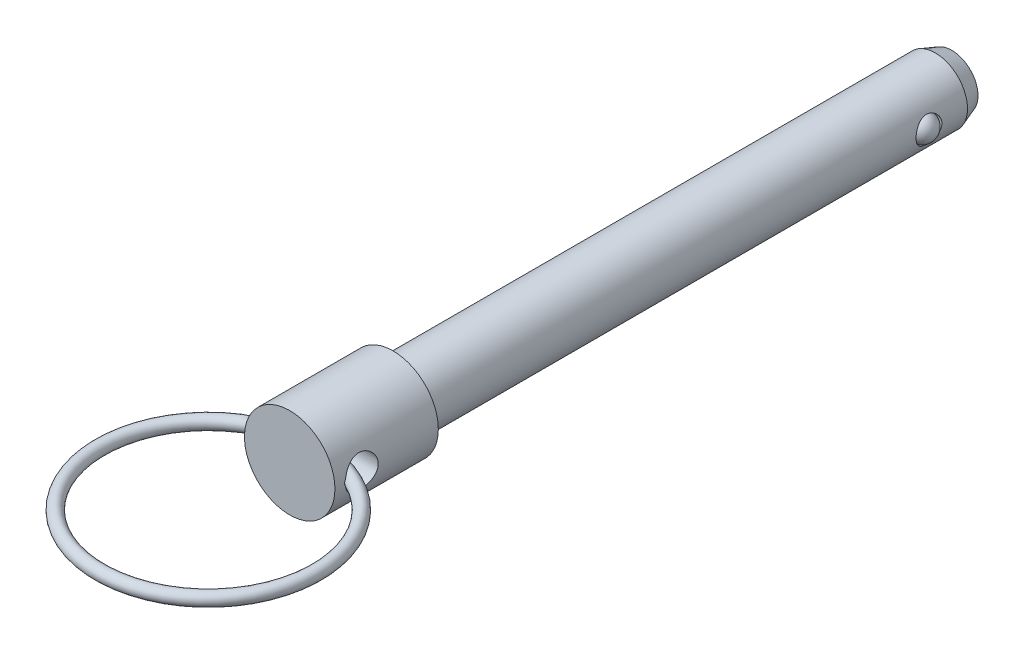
ISO-10303-21;
HEADER;
FILE_DESCRIPTION(('STEP AP214'),'2;1');
FILE_NAME('part.step','',(''),(''),'','','');
FILE_SCHEMA(('AUTOMOTIVE_DESIGN { 1 0 10303 214 1 1 1 1 }'));
ENDSEC;
DATA;
#1=APPLICATION_CONTEXT('core data for automotive mechanical design processes');
#2=APPLICATION_PROTOCOL_DEFINITION('international standard','automotive_design',2000,#1);
#3=PRODUCT_CONTEXT('',#1,'mechanical');
#4=PRODUCT('Part','Part','',(#3));
#5=PRODUCT_RELATED_PRODUCT_CATEGORY('part','',(#4));
#6=PRODUCT_DEFINITION_FORMATION('','',#4);
#7=PRODUCT_DEFINITION_CONTEXT('part definition',#1,'design');
#8=PRODUCT_DEFINITION('design','',#6,#7);
#9=PRODUCT_DEFINITION_SHAPE('','',#8);
#10=(LENGTH_UNIT() NAMED_UNIT(*) SI_UNIT(.MILLI.,.METRE.));
#11=(NAMED_UNIT(*) PLANE_ANGLE_UNIT() SI_UNIT($,.RADIAN.));
#12=(NAMED_UNIT(*) SI_UNIT($,.STERADIAN.) SOLID_ANGLE_UNIT());
#13=UNCERTAINTY_MEASURE_WITH_UNIT(LENGTH_MEASURE(1.E-05),#10,'distance_accuracy_value','');
#14=(GEOMETRIC_REPRESENTATION_CONTEXT(3) GLOBAL_UNCERTAINTY_ASSIGNED_CONTEXT((#13)) GLOBAL_UNIT_ASSIGNED_CONTEXT((#10,
#11,#12)) REPRESENTATION_CONTEXT('',''));
#15=CARTESIAN_POINT('',(0.,0.,0.));
#16=DIRECTION('',(0.,0.,1.));
#17=DIRECTION('',(1.,0.,0.));
#18=AXIS2_PLACEMENT_3D('',#15,#16,#17);
#19=CARTESIAN_POINT('',(7.9375,0.,9.398));
#20=DIRECTION('',(-1.,0.,0.));
#21=DIRECTION('',(0.,0.,-1.));
#22=AXIS2_PLACEMENT_3D('',#19,#20,#21);
#23=CYLINDRICAL_SURFACE('',#22,2.0193);
#24=CARTESIAN_POINT('',(-5.55645,0.413388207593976,11.3745329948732));
#25=CARTESIAN_POINT('',(-5.53323669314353,0.388835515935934,11.3796705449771));
#26=CARTESIAN_POINT('',(-5.51157389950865,0.362641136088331,11.3846690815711));
#27=CARTESIAN_POINT('',(-5.47216390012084,0.307044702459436,11.3940198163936));
#28=CARTESIAN_POINT('',(-5.45444977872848,0.277618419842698,11.3983664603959));
#29=CARTESIAN_POINT('',(-5.42406600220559,0.215851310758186,11.4059720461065));
#30=CARTESIAN_POINT('',(-5.41142802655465,0.183493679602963,11.4092241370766));
#31=CARTESIAN_POINT('',(-5.3923512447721,0.116986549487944,11.4141821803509));
#32=CARTESIAN_POINT('',(-5.38588919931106,0.0828442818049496,11.4158939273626));
#33=CARTESIAN_POINT('',(-5.37995615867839,0.0172985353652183,11.4174656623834));
#34=CARTESIAN_POINT('',(-5.37986165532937,-0.0140451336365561,11.4174908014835));
#35=CARTESIAN_POINT('',(-5.38511249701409,-0.0762532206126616,11.4160995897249));
#36=CARTESIAN_POINT('',(-5.39046041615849,-0.107117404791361,11.4146825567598));
#37=CARTESIAN_POINT('',(-5.40574321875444,-0.165640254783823,11.4106965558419));
#38=CARTESIAN_POINT('',(-5.41539031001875,-0.193380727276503,11.408200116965));
#39=CARTESIAN_POINT('',(-5.43862859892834,-0.247073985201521,11.4023097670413));
#40=CARTESIAN_POINT('',(-5.45222392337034,-0.273024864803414,11.398914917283));
#41=CARTESIAN_POINT('',(-5.48024922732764,-0.318737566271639,11.3920973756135));
#42=CARTESIAN_POINT('',(-5.49418727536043,-0.338820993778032,11.3887682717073));
#43=CARTESIAN_POINT('',(-5.523970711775,-0.377330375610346,11.3818282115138));
#44=CARTESIAN_POINT('',(-5.53980753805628,-0.395763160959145,11.378218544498));
#45=CARTESIAN_POINT('',(-5.55645,-0.413388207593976,11.3745329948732));
#46=B_SPLINE_CURVE_WITH_KNOTS('',3,(#24,#25,#26,#27,#28,#29,#30,#31,#32,#33,#34,#35,#36,#37,#38,
#39,#40,#41,#42,#43,#44,#45),.UNSPECIFIED.,.F.,.F.,(4,2,2,2,2,2,2,2,2,2,4),(0.,
0.102621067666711,0.20607208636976,0.310159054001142,0.413852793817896,0.507376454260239,
0.600944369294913,0.689017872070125,0.777183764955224,0.851068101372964,0.92463098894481),.UNSPECIFIED.);
#47=CARTESIAN_POINT('',(-5.54200209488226,0.397651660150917,11.3777589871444));
#48=VERTEX_POINT('',#47);
#49=CARTESIAN_POINT('',(-5.54200209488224,-0.397651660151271,11.3777589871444));
#50=VERTEX_POINT('',#49);
#51=EDGE_CURVE('E40',#48,#50,#46,.T.);
#52=ORIENTED_EDGE('',*,*,#51,.F.);
#53=CARTESIAN_POINT('',(-5.55625,0.,11.4173));
#54=CARTESIAN_POINT('',(-5.55624527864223,-0.109432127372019,11.4172937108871));
#55=CARTESIAN_POINT('',(-5.55298237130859,-0.218969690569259,11.408361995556));
#56=CARTESIAN_POINT('',(-5.54026368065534,-0.434902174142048,11.372953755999));
#57=CARTESIAN_POINT('',(-5.53079819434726,-0.541291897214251,11.3464497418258));
#58=CARTESIAN_POINT('',(-5.50670156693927,-0.74760504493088,11.2769560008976));
#59=CARTESIAN_POINT('',(-5.49208344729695,-0.847544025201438,11.2340078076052));
#60=CARTESIAN_POINT('',(-5.45915039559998,-1.03875753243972,11.1330083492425));
#61=CARTESIAN_POINT('',(-5.44083572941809,-1.13003268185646,11.0749581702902));
#62=CARTESIAN_POINT('',(-5.40158114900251,-1.30505728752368,10.9429422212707));
#63=CARTESIAN_POINT('',(-5.38056990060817,-1.38841141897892,10.8684736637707));
#64=CARTESIAN_POINT('',(-5.33865236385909,-1.54176439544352,10.7067995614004));
#65=CARTESIAN_POINT('',(-5.31774611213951,-1.61175885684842,10.6195898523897));
#66=CARTESIAN_POINT('',(-5.27759352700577,-1.73882919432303,10.4311528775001));
#67=CARTESIAN_POINT('',(-5.25843183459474,-1.79536185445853,10.3295394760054));
#68=CARTESIAN_POINT('',(-5.22503611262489,-1.89036141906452,10.1174402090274));
#69=CARTESIAN_POINT('',(-5.21080023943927,-1.92883508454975,10.0069576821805));
#70=CARTESIAN_POINT('',(-5.18962447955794,-1.98509166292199,9.78477737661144));
#71=CARTESIAN_POINT('',(-5.18242178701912,-2.00362275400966,9.67329490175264));
#72=CARTESIAN_POINT('',(-5.17535625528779,-2.02180769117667,9.44858805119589));
#73=CARTESIAN_POINT('',(-5.17549061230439,-2.02146874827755,9.33536435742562));
#74=CARTESIAN_POINT('',(-5.18285629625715,-2.00249790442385,9.11709454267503));
#75=CARTESIAN_POINT('',(-5.18969215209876,-1.98488533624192,9.01194405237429));
#76=CARTESIAN_POINT('',(-5.20903632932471,-1.93354575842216,8.80620743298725));
#77=CARTESIAN_POINT('',(-5.22154547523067,-1.89981640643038,8.70562196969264));
#78=CARTESIAN_POINT('',(-5.25107746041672,-1.81661001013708,8.50972358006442));
#79=CARTESIAN_POINT('',(-5.26817827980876,-1.76685762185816,8.41453987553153));
#80=CARTESIAN_POINT('',(-5.30493780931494,-1.65321144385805,8.23357336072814));
#81=CARTESIAN_POINT('',(-5.32459724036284,-1.58931366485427,8.14779321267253));
#82=CARTESIAN_POINT('',(-5.36576425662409,-1.44447059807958,7.98240722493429));
#83=CARTESIAN_POINT('',(-5.38731044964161,-1.36270785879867,7.90352531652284));
#84=CARTESIAN_POINT('',(-5.42876622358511,-1.18682967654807,7.76035905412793));
#85=CARTESIAN_POINT('',(-5.44867505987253,-1.09270866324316,7.69608131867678));
#86=CARTESIAN_POINT('',(-5.48497084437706,-0.893001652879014,7.58320896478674));
#87=CARTESIAN_POINT('',(-5.5013029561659,-0.787270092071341,7.53485348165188));
#88=CARTESIAN_POINT('',(-5.52817729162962,-0.568540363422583,7.45692936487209));
#89=CARTESIAN_POINT('',(-5.53873126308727,-0.455557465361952,7.42732259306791));
#90=CARTESIAN_POINT('',(-5.54924569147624,-0.284581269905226,7.39803699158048));
#91=CARTESIAN_POINT('',(-5.55186369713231,-0.227949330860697,7.3907957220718));
#92=CARTESIAN_POINT('',(-5.55536708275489,-0.114221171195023,7.3811255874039));
#93=CARTESIAN_POINT('',(-5.55625246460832,-0.0571249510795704,7.37869671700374));
#94=CARTESIAN_POINT('',(-5.55624527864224,0.10943212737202,7.37870628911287));
#95=CARTESIAN_POINT('',(-5.55298237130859,0.21896969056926,7.38763800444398));
#96=CARTESIAN_POINT('',(-5.54026368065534,0.434902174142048,7.42304624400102));
#97=CARTESIAN_POINT('',(-5.53079819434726,0.541291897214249,7.44955025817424));
#98=CARTESIAN_POINT('',(-5.50670156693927,0.74760504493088,7.51904399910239));
#99=CARTESIAN_POINT('',(-5.49208344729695,0.847544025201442,7.56199219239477));
#100=CARTESIAN_POINT('',(-5.45915039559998,1.03875753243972,7.66299165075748));
#101=CARTESIAN_POINT('',(-5.44083572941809,1.13003268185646,7.7210418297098));
#102=CARTESIAN_POINT('',(-5.40158114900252,1.30505728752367,7.85305777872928));
#103=CARTESIAN_POINT('',(-5.38056990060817,1.38841141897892,7.92752633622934));
#104=CARTESIAN_POINT('',(-5.33865236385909,1.54176439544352,8.08920043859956));
#105=CARTESIAN_POINT('',(-5.31774611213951,1.61175885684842,8.17641014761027));
#106=CARTESIAN_POINT('',(-5.27759352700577,1.73882919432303,8.36484712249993));
#107=CARTESIAN_POINT('',(-5.25843183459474,1.79536185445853,8.46646052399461));
#108=CARTESIAN_POINT('',(-5.22503611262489,1.89036141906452,8.67855979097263));
#109=CARTESIAN_POINT('',(-5.21080023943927,1.92883508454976,8.78904231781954));
#110=CARTESIAN_POINT('',(-5.18962447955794,1.985091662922,9.01122262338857));
#111=CARTESIAN_POINT('',(-5.18242178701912,2.00362275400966,9.12270509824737));
#112=CARTESIAN_POINT('',(-5.17535625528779,2.02180769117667,9.34741194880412));
#113=CARTESIAN_POINT('',(-5.17549061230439,2.02146874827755,9.46063564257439));
#114=CARTESIAN_POINT('',(-5.18285629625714,2.00249790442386,9.67890545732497));
#115=CARTESIAN_POINT('',(-5.18969215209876,1.98488533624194,9.78405594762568));
#116=CARTESIAN_POINT('',(-5.20903632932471,1.93354575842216,9.98979256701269));
#117=CARTESIAN_POINT('',(-5.22154547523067,1.89981640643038,10.0903780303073));
#118=CARTESIAN_POINT('',(-5.25107746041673,1.81661001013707,10.2862764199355));
#119=CARTESIAN_POINT('',(-5.26817827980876,1.76685762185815,10.3814601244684));
#120=CARTESIAN_POINT('',(-5.30493780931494,1.65321144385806,10.5624266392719));
#121=CARTESIAN_POINT('',(-5.32459724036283,1.58931366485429,10.6482067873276));
#122=CARTESIAN_POINT('',(-5.36576425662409,1.44447059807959,10.8135927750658));
#123=CARTESIAN_POINT('',(-5.38731044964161,1.36270785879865,10.8924746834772));
#124=CARTESIAN_POINT('',(-5.42876622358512,1.18682967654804,11.0356409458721));
#125=CARTESIAN_POINT('',(-5.44867505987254,1.09270866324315,11.0999186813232));
#126=CARTESIAN_POINT('',(-5.48497084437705,0.893001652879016,11.2127910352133));
#127=CARTESIAN_POINT('',(-5.5013029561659,0.787270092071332,11.2611465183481));
#128=CARTESIAN_POINT('',(-5.52817729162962,0.568540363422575,11.3390706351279));
#129=CARTESIAN_POINT('',(-5.53873126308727,0.455557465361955,11.3686774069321));
#130=CARTESIAN_POINT('',(-5.54924569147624,0.28458126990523,11.3979630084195));
#131=CARTESIAN_POINT('',(-5.55186369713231,0.227949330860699,11.4052042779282));
#132=CARTESIAN_POINT('',(-5.55536708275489,0.114221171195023,11.4148744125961));
#133=CARTESIAN_POINT('',(-5.55625246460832,0.0571249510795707,11.4173032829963));
#134=CARTESIAN_POINT('',(-5.55625,0.,11.4173));
#135=B_SPLINE_CURVE_WITH_KNOTS('',3,(#53,#54,#55,#56,#57,#58,#59,#60,#61,#62,#63,#64,#65,#66,
#67,#68,#69,#70,#71,#72,#73,#74,#75,#76,#77,#78,#79,#80,#81,#82,#83,#84,#85,#86,#87,#88,#89,#90,
#91,#92,#93,#94,#95,#96,#97,#98,#99,#100,#101,#102,#103,#104,#105,#106,#107,#108,#109,#110,#111,
#112,#113,#114,#115,#116,#117,#118,#119,#120,#121,#122,#123,#124,#125,#126,#127,#128,#129,#130,
#131,#132,#133,#134),.UNSPECIFIED.,.T.,.F.,(4,2,2,2,2,2,2,2,2,2,2,2,2,2,2,2,2,2,2,2,2,2,2,2,2,2,
2,2,2,2,2,2,2,2,2,2,2,2,2,2,4),(0.,0.32807537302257,0.656665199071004,0.984430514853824,
1.31217226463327,1.65185430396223,1.99164760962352,2.3434350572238,2.69509069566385,
3.03303658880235,3.3708533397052,3.68986542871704,4.00892389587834,4.33378721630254,
4.65874227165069,5.00406386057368,5.3495416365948,5.69999369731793,6.04973056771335,
6.22099023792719,6.39224972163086,6.72032509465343,7.04891492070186,7.37668023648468,
7.70442198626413,8.04410402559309,8.38389733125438,8.73568477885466,9.08734041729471,
9.42528631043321,9.76310306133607,10.0821151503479,10.4011736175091,10.7260369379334,
11.0509919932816,11.3963135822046,11.7417913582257,12.0922434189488,12.4419802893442,
12.6132399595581,12.7844994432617),.UNSPECIFIED.);
#136=EDGE_CURVE('E66',#50,#48,#135,.T.);
#137=ORIENTED_EDGE('',*,*,#136,.F.);
#138=EDGE_LOOP('',(#52,#137));
#139=FACE_BOUND('',#138,.T.);
#140=CARTESIAN_POINT('',(5.55645,-0.413388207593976,11.3745329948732));
#141=CARTESIAN_POINT('',(5.53323669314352,-0.388835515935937,11.3796705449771));
#142=CARTESIAN_POINT('',(5.51157389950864,-0.362641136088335,11.3846690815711));
#143=CARTESIAN_POINT('',(5.47216390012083,-0.307044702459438,11.3940198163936));
#144=CARTESIAN_POINT('',(5.45444977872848,-0.277618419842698,11.3983664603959));
#145=CARTESIAN_POINT('',(5.42406600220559,-0.215851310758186,11.4059720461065));
#146=CARTESIAN_POINT('',(5.41142802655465,-0.183493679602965,11.4092241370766));
#147=CARTESIAN_POINT('',(5.39235124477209,-0.116986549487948,11.4141821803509));
#148=CARTESIAN_POINT('',(5.38588919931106,-0.0828442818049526,11.4158939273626));
#149=CARTESIAN_POINT('',(5.37995615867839,-0.0172985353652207,11.4174656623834));
#150=CARTESIAN_POINT('',(5.37986165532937,0.0140451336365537,11.4174908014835));
#151=CARTESIAN_POINT('',(5.38511249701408,0.0762532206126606,11.4160995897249));
#152=CARTESIAN_POINT('',(5.39046041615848,0.107117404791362,11.4146825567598));
#153=CARTESIAN_POINT('',(5.40574321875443,0.165640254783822,11.4106965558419));
#154=CARTESIAN_POINT('',(5.41539031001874,0.1933807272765,11.408200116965));
#155=CARTESIAN_POINT('',(5.43862859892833,0.247073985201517,11.4023097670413));
#156=CARTESIAN_POINT('',(5.45222392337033,0.273024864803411,11.398914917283));
#157=CARTESIAN_POINT('',(5.48024922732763,0.318737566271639,11.3920973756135));
#158=CARTESIAN_POINT('',(5.49418727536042,0.338820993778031,11.3887682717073));
#159=CARTESIAN_POINT('',(5.523970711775,0.377330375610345,11.3818282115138));
#160=CARTESIAN_POINT('',(5.53980753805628,0.395763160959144,11.378218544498));
#161=CARTESIAN_POINT('',(5.55645,0.413388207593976,11.3745329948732));
#162=B_SPLINE_CURVE_WITH_KNOTS('',3,(#140,#141,#142,#143,#144,#145,#146,#147,#148,#149,#150,
#151,#152,#153,#154,#155,#156,#157,#158,#159,#160,#161),.UNSPECIFIED.,.F.,.F.,(4,2,2,2,2,2,2,2,
2,2,4),(0.,0.102621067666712,0.206072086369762,0.310159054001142,0.413852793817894,
0.507376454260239,0.600944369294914,0.689017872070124,0.777183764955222,0.851068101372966,
0.924630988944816),.UNSPECIFIED.);
#163=CARTESIAN_POINT('',(5.54200209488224,-0.397651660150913,11.3777589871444));
#164=VERTEX_POINT('',#163);
#165=CARTESIAN_POINT('',(5.54200209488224,0.397651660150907,11.3777589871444));
#166=VERTEX_POINT('',#165);
#167=EDGE_CURVE('E33',#164,#166,#162,.T.);
#168=ORIENTED_EDGE('',*,*,#167,.F.);
#169=CARTESIAN_POINT('',(5.55625,0.,7.3787));
#170=CARTESIAN_POINT('',(5.55624527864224,-0.109432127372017,7.37870628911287));
#171=CARTESIAN_POINT('',(5.55298237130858,-0.218969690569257,7.38763800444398));
#172=CARTESIAN_POINT('',(5.54026368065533,-0.434902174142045,7.42304624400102));
#173=CARTESIAN_POINT('',(5.53079819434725,-0.541291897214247,7.44955025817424));
#174=CARTESIAN_POINT('',(5.50670156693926,-0.747605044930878,7.51904399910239));
#175=CARTESIAN_POINT('',(5.49208344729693,-0.847544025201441,7.56199219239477));
#176=CARTESIAN_POINT('',(5.45915039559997,-1.03875753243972,7.66299165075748));
#177=CARTESIAN_POINT('',(5.44083572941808,-1.13003268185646,7.7210418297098));
#178=CARTESIAN_POINT('',(5.4015811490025,-1.30505728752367,7.85305777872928));
#179=CARTESIAN_POINT('',(5.38056990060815,-1.38841141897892,7.92752633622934));
#180=CARTESIAN_POINT('',(5.33865236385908,-1.54176439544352,8.08920043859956));
#181=CARTESIAN_POINT('',(5.31774611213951,-1.61175885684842,8.17641014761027));
#182=CARTESIAN_POINT('',(5.27759352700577,-1.73882919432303,8.36484712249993));
#183=CARTESIAN_POINT('',(5.25843183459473,-1.79536185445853,8.46646052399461));
#184=CARTESIAN_POINT('',(5.22503611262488,-1.89036141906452,8.67855979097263));
#185=CARTESIAN_POINT('',(5.21080023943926,-1.92883508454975,8.78904231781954));
#186=CARTESIAN_POINT('',(5.18962447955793,-1.98509166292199,9.01122262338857));
#187=CARTESIAN_POINT('',(5.18242178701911,-2.00362275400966,9.12270509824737));
#188=CARTESIAN_POINT('',(5.17535625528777,-2.02180769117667,9.34741194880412));
#189=CARTESIAN_POINT('',(5.17549061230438,-2.02146874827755,9.46063564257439));
#190=CARTESIAN_POINT('',(5.18285629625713,-2.00249790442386,9.67890545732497));
#191=CARTESIAN_POINT('',(5.18969215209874,-1.98488533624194,9.78405594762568));
#192=CARTESIAN_POINT('',(5.2090363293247,-1.93354575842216,9.98979256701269));
#193=CARTESIAN_POINT('',(5.22154547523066,-1.89981640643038,10.0903780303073));
#194=CARTESIAN_POINT('',(5.25107746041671,-1.81661001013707,10.2862764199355));
#195=CARTESIAN_POINT('',(5.26817827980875,-1.76685762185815,10.3814601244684));
#196=CARTESIAN_POINT('',(5.30493780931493,-1.65321144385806,10.5624266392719));
#197=CARTESIAN_POINT('',(5.32459724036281,-1.58931366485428,10.6482067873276));
#198=CARTESIAN_POINT('',(5.36576425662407,-1.44447059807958,10.8135927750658));
#199=CARTESIAN_POINT('',(5.3873104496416,-1.36270785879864,10.8924746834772));
#200=CARTESIAN_POINT('',(5.42876622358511,-1.18682967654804,11.0356409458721));
#201=CARTESIAN_POINT('',(5.44867505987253,-1.09270866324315,11.0999186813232));
#202=CARTESIAN_POINT('',(5.48497084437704,-0.893001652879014,11.2127910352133));
#203=CARTESIAN_POINT('',(5.50130295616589,-0.78727009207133,11.2611465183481));
#204=CARTESIAN_POINT('',(5.52817729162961,-0.568540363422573,11.3390706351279));
#205=CARTESIAN_POINT('',(5.53873126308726,-0.455557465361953,11.3686774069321));
#206=CARTESIAN_POINT('',(5.54924569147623,-0.284581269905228,11.3979630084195));
#207=CARTESIAN_POINT('',(5.55186369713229,-0.227949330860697,11.4052042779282));
#208=CARTESIAN_POINT('',(5.55536708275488,-0.114221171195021,11.4148744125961));
#209=CARTESIAN_POINT('',(5.55625246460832,-0.0571249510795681,11.4173032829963));
#210=CARTESIAN_POINT('',(5.55624527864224,0.109432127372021,11.4172937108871));
#211=CARTESIAN_POINT('',(5.55298237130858,0.218969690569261,11.408361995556));
#212=CARTESIAN_POINT('',(5.54026368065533,0.43490217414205,11.372953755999));
#213=CARTESIAN_POINT('',(5.53079819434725,0.541291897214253,11.3464497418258));
#214=CARTESIAN_POINT('',(5.50670156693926,0.747605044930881,11.2769560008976));
#215=CARTESIAN_POINT('',(5.49208344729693,0.847544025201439,11.2340078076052));
#216=CARTESIAN_POINT('',(5.45915039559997,1.03875753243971,11.1330083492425));
#217=CARTESIAN_POINT('',(5.44083572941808,1.13003268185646,11.0749581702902));
#218=CARTESIAN_POINT('',(5.4015811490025,1.30505728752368,10.9429422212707));
#219=CARTESIAN_POINT('',(5.38056990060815,1.38841141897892,10.8684736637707));
#220=CARTESIAN_POINT('',(5.33865236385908,1.54176439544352,10.7067995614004));
#221=CARTESIAN_POINT('',(5.31774611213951,1.61175885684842,10.6195898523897));
#222=CARTESIAN_POINT('',(5.27759352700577,1.73882919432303,10.4311528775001));
#223=CARTESIAN_POINT('',(5.25843183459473,1.79536185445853,10.3295394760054));
#224=CARTESIAN_POINT('',(5.22503611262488,1.89036141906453,10.1174402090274));
#225=CARTESIAN_POINT('',(5.21080023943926,1.92883508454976,10.0069576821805));
#226=CARTESIAN_POINT('',(5.18962447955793,1.98509166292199,9.78477737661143));
#227=CARTESIAN_POINT('',(5.18242178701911,2.00362275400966,9.67329490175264));
#228=CARTESIAN_POINT('',(5.17535625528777,2.02180769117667,9.44858805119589));
#229=CARTESIAN_POINT('',(5.17549061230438,2.02146874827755,9.33536435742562));
#230=CARTESIAN_POINT('',(5.18285629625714,2.00249790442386,9.11709454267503));
#231=CARTESIAN_POINT('',(5.18969215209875,1.98488533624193,9.01194405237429));
#232=CARTESIAN_POINT('',(5.2090363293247,1.93354575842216,8.80620743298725));
#233=CARTESIAN_POINT('',(5.22154547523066,1.89981640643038,8.70562196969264));
#234=CARTESIAN_POINT('',(5.25107746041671,1.81661001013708,8.50972358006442));
#235=CARTESIAN_POINT('',(5.26817827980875,1.76685762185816,8.41453987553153));
#236=CARTESIAN_POINT('',(5.30493780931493,1.65321144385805,8.23357336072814));
#237=CARTESIAN_POINT('',(5.32459724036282,1.58931366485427,8.14779321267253));
#238=CARTESIAN_POINT('',(5.36576425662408,1.44447059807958,7.98240722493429));
#239=CARTESIAN_POINT('',(5.3873104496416,1.36270785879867,7.90352531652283));
#240=CARTESIAN_POINT('',(5.4287662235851,1.18682967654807,7.76035905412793));
#241=CARTESIAN_POINT('',(5.44867505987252,1.09270866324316,7.69608131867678));
#242=CARTESIAN_POINT('',(5.48497084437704,0.893001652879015,7.58320896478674));
#243=CARTESIAN_POINT('',(5.50130295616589,0.787270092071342,7.53485348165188));
#244=CARTESIAN_POINT('',(5.52817729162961,0.568540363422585,7.45692936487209));
#245=CARTESIAN_POINT('',(5.53873126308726,0.455557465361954,7.42732259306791));
#246=CARTESIAN_POINT('',(5.54924569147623,0.284581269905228,7.39803699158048));
#247=CARTESIAN_POINT('',(5.55186369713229,0.227949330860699,7.3907957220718));
#248=CARTESIAN_POINT('',(5.55536708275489,0.114221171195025,7.3811255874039));
#249=CARTESIAN_POINT('',(5.55625246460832,0.0571249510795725,7.37869671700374));
#250=CARTESIAN_POINT('',(5.55625,0.,7.3787));
#251=B_SPLINE_CURVE_WITH_KNOTS('',3,(#169,#170,#171,#172,#173,#174,#175,#176,#177,#178,#179,
#180,#181,#182,#183,#184,#185,#186,#187,#188,#189,#190,#191,#192,#193,#194,#195,#196,#197,#198,
#199,#200,#201,#202,#203,#204,#205,#206,#207,#208,#209,#210,#211,#212,#213,#214,#215,#216,#217,
#218,#219,#220,#221,#222,#223,#224,#225,#226,#227,#228,#229,#230,#231,#232,#233,#234,#235,#236,
#237,#238,#239,#240,#241,#242,#243,#244,#245,#246,#247,#248,#249,#250),.UNSPECIFIED.,.T.,.F.,(4,
2,2,2,2,2,2,2,2,2,2,2,2,2,2,2,2,2,2,2,2,2,2,2,2,2,2,2,2,2,2,2,2,2,2,2,2,2,2,2,4),(0.,
0.328075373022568,0.656665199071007,0.984430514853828,1.31217226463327,1.65185430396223,
1.99164760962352,2.3434350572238,2.69509069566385,3.03303658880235,3.37085333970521,
3.68986542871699,4.00892389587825,4.33378721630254,4.65874227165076,5.00406386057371,
5.34954163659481,5.69999369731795,6.04973056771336,6.2209902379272,6.39224972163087,
6.72032509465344,7.04891492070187,7.37668023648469,7.70442198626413,8.04410402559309,
8.38389733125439,8.73568477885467,9.08734041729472,9.42528631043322,9.76310306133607,
10.0821151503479,10.4011736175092,10.7260369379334,11.0509919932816,11.3963135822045,
11.7417913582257,12.0922434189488,12.4419802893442,12.6132399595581,12.7844994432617),.UNSPECIFIED.);
#252=EDGE_CURVE('E62',#166,#164,#251,.T.);
#253=ORIENTED_EDGE('',*,*,#252,.F.);
#254=EDGE_LOOP('',(#168,#253));
#255=FACE_BOUND('',#254,.T.);
#256=ADVANCED_FACE('F14',(#139,#255),#23,.F.);
#257=CARTESIAN_POINT('',(0.,0.,-28.63596));
#258=DIRECTION('',(0.,0.,-1.));
#259=DIRECTION('',(1.,0.,0.));
#260=AXIS2_PLACEMENT_3D('',#257,#258,#259);
#261=CYLINDRICAL_SURFACE('',#260,5.55625);
#262=ORIENTED_EDGE('',*,*,#252,.T.);
#263=CARTESIAN_POINT('',(5.55009347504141,-0.261488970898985,9.786084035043));
#264=CARTESIAN_POINT('',(5.54812529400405,-0.303251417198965,9.80096224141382));
#265=CARTESIAN_POINT('',(5.5457404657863,-0.343758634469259,9.81942005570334));
#266=CARTESIAN_POINT('',(5.54040847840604,-0.421066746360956,9.86292845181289));
#267=CARTESIAN_POINT('',(5.5374605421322,-0.457862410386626,9.88798816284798));
#268=CARTESIAN_POINT('',(5.53134134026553,-0.526658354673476,9.94386457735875));
#269=CARTESIAN_POINT('',(5.52817046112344,-0.558666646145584,9.97467146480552));
#270=CARTESIAN_POINT('',(5.52194469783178,-0.617178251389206,10.0411137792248));
#271=CARTESIAN_POINT('',(5.51888978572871,-0.643682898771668,10.0767480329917));
#272=CARTESIAN_POINT('',(5.51313628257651,-0.691254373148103,10.1527268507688));
#273=CARTESIAN_POINT('',(5.51044827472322,-0.712171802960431,10.1931655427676));
#274=CARTESIAN_POINT('',(5.50578097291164,-0.747399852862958,10.2768577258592));
#275=CARTESIAN_POINT('',(5.50380188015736,-0.761708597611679,10.3201120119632));
#276=CARTESIAN_POINT('',(5.50062483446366,-0.784334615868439,10.4110491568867));
#277=CARTESIAN_POINT('',(5.4994831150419,-0.792223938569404,10.4588401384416));
#278=CARTESIAN_POINT('',(5.49826873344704,-0.800607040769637,10.5550754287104));
#279=CARTESIAN_POINT('',(5.49819646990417,-0.801098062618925,10.6035199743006));
#280=CARTESIAN_POINT('',(5.49912806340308,-0.794680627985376,10.7039443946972));
#281=CARTESIAN_POINT('',(5.5002216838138,-0.787154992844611,10.7558841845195));
#282=CARTESIAN_POINT('',(5.50347103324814,-0.7641034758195,10.8579332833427));
#283=CARTESIAN_POINT('',(5.5056272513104,-0.748573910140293,10.9080417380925));
#284=CARTESIAN_POINT('',(5.51091051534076,-0.708667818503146,11.0082212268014));
#285=CARTESIAN_POINT('',(5.51408971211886,-0.683800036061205,11.0580951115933));
#286=CARTESIAN_POINT('',(5.52096808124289,-0.625839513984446,11.1528267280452));
#287=CARTESIAN_POINT('',(5.52466742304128,-0.592744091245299,11.1976828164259));
#288=CARTESIAN_POINT('',(5.53199718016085,-0.519831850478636,11.2794067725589));
#289=CARTESIAN_POINT('',(5.53562669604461,-0.480224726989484,11.3164602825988));
#290=CARTESIAN_POINT('',(5.54239660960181,-0.394450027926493,11.3820559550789));
#291=CARTESIAN_POINT('',(5.54553772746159,-0.348292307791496,11.4106107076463));
#292=CARTESIAN_POINT('',(5.55042537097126,-0.257766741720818,11.4537693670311));
#293=CARTESIAN_POINT('',(5.55230678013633,-0.214079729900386,11.4697807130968));
#294=CARTESIAN_POINT('',(5.55503790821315,-0.124373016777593,11.4927832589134));
#295=CARTESIAN_POINT('',(5.55588906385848,-0.0783566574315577,11.4997870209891));
#296=CARTESIAN_POINT('',(5.55638432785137,0.00705853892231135,11.5038718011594));
#297=CARTESIAN_POINT('',(5.55619261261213,0.0463971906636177,11.5023023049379));
#298=CARTESIAN_POINT('',(5.55499790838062,0.124194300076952,11.4923961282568));
#299=CARTESIAN_POINT('',(5.5539950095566,0.162652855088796,11.484060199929));
#300=CARTESIAN_POINT('',(5.55133569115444,0.23645535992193,11.4614747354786));
#301=CARTESIAN_POINT('',(5.54970019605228,0.271858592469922,11.4474138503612));
#302=CARTESIAN_POINT('',(5.54593788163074,0.340082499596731,11.414086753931));
#303=CARTESIAN_POINT('',(5.54381093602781,0.372902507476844,11.394819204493));
#304=CARTESIAN_POINT('',(5.53902830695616,0.438479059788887,11.3497412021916));
#305=CARTESIAN_POINT('',(5.53634134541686,0.470920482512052,11.3234773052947));
#306=CARTESIAN_POINT('',(5.53084030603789,0.531649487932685,11.2665410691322));
#307=CARTESIAN_POINT('',(5.52802616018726,0.559934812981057,11.2358663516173));
#308=CARTESIAN_POINT('',(5.52207389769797,0.616058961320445,11.1660010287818));
#309=CARTESIAN_POINT('',(5.51895184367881,0.64317151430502,11.1262251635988));
#310=CARTESIAN_POINT('',(5.5131400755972,0.691221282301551,11.0430715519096));
#311=CARTESIAN_POINT('',(5.51045062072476,0.71215480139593,10.9996916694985));
#312=CARTESIAN_POINT('',(5.50546631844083,0.749774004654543,10.9047684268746));
#313=CARTESIAN_POINT('',(5.50326207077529,0.765608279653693,10.8528805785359));
#314=CARTESIAN_POINT('',(5.49999925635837,0.788707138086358,10.7471802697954));
#315=CARTESIAN_POINT('',(5.49894104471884,0.795969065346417,10.693367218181));
#316=CARTESIAN_POINT('',(5.49812737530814,0.80157359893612,10.5836973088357));
#317=CARTESIAN_POINT('',(5.49841008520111,0.799654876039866,10.5278260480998));
#318=CARTESIAN_POINT('',(5.50039129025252,0.785912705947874,10.4173293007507));
#319=CARTESIAN_POINT('',(5.50208922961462,0.774093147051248,10.3627033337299));
#320=CARTESIAN_POINT('',(5.50657222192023,0.741502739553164,10.2600057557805));
#321=CARTESIAN_POINT('',(5.50928213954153,0.721341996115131,10.2117380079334));
#322=CARTESIAN_POINT('',(5.5154579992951,0.672487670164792,10.1197820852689));
#323=CARTESIAN_POINT('',(5.51892350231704,0.643799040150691,10.0760912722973));
#324=CARTESIAN_POINT('',(5.5258260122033,0.581424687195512,9.99852087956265));
#325=CARTESIAN_POINT('',(5.52923968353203,0.548383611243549,9.96412004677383));
#326=CARTESIAN_POINT('',(5.53588272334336,0.476663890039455,9.90178589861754));
#327=CARTESIAN_POINT('',(5.53911216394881,0.437987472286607,9.87385003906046));
#328=CARTESIAN_POINT('',(5.54480401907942,0.35854502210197,9.82683552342));
#329=CARTESIAN_POINT('',(5.54729992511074,0.318028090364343,9.80733901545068));
#330=CARTESIAN_POINT('',(5.55147034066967,0.234199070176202,9.7755782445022));
#331=CARTESIAN_POINT('',(5.55314476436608,0.190886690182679,9.76331473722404));
#332=CARTESIAN_POINT('',(5.55544526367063,0.103875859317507,9.74662090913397));
#333=CARTESIAN_POINT('',(5.55609634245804,0.060213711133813,9.7420036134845));
#334=CARTESIAN_POINT('',(5.55635470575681,-0.0272293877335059,9.74015977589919));
#335=CARTESIAN_POINT('',(5.5559634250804,-0.0710100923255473,9.74292307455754));
#336=CARTESIAN_POINT('',(5.55456091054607,-0.13928994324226,9.75303365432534));
#337=CARTESIAN_POINT('',(5.55387840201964,-0.16417689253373,9.75797314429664));
#338=CARTESIAN_POINT('',(5.55220711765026,-0.213342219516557,9.77024669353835));
#339=CARTESIAN_POINT('',(5.55121834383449,-0.237620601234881,9.7775807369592));
#340=CARTESIAN_POINT('',(5.55009347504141,-0.261488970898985,9.786084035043));
#341=B_SPLINE_CURVE_WITH_KNOTS('',3,(#263,#264,#265,#266,#267,#268,#269,#270,#271,#272,#273,
#274,#275,#276,#277,#278,#279,#280,#281,#282,#283,#284,#285,#286,#287,#288,#289,#290,#291,#292,
#293,#294,#295,#296,#297,#298,#299,#300,#301,#302,#303,#304,#305,#306,#307,#308,#309,#310,#311,
#312,#313,#314,#315,#316,#317,#318,#319,#320,#321,#322,#323,#324,#325,#326,#327,#328,#329,#330,
#331,#332,#333,#334,#335,#336,#337,#338,#339,#340),.UNSPECIFIED.,.T.,.F.,(4,2,2,2,2,2,2,2,2,2,2,
2,2,2,2,2,2,2,2,2,2,2,2,2,2,2,2,2,2,2,2,2,2,2,2,2,2,2,4),(0.,0.133035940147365,0.2662568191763,
0.399252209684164,0.532215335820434,0.668441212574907,0.804705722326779,0.949444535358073,
1.09423729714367,1.25104087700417,1.4079166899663,1.57457416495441,1.74128605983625,
1.90341673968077,2.06530602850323,2.20414603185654,2.34279219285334,2.46030997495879,
2.57781469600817,2.69172579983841,2.8056662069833,2.93066170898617,3.05572486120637,
3.19986521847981,3.34409161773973,3.50624490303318,3.66844841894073,3.83529611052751,
4.00207830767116,4.15836501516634,4.31456113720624,4.45728171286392,4.59994602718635,
4.73438372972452,4.86883547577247,4.99994808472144,5.13088030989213,5.20691445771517,
5.28294810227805),.UNSPECIFIED.);
#342=EDGE_CURVE('E27',#164,#166,#341,.T.);
#343=ORIENTED_EDGE('',*,*,#342,.T.);
#344=EDGE_LOOP('',(#262,#343));
#345=FACE_BOUND('',#344,.T.);
#346=CARTESIAN_POINT('',(0.,0.,-8.26977375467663E-11));
#347=DIRECTION('',(0.,0.,-1.));
#348=DIRECTION('',(1.,0.,0.));
#349=AXIS2_PLACEMENT_3D('',#346,#347,#348);
#350=CIRCLE('',#349,5.55625000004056);
#351=CARTESIAN_POINT('',(5.55625000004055,0.,-8.2697982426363E-11));
#352=VERTEX_POINT('',#351);
#353=EDGE_CURVE('E70',#352,#352,#350,.T.);
#354=ORIENTED_EDGE('',*,*,#353,.F.);
#355=EDGE_LOOP('',(#354));
#356=FACE_BOUND('',#355,.T.);
#357=CARTESIAN_POINT('',(0.,0.,12.7000000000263));
#358=DIRECTION('',(0.,0.,-1.));
#359=DIRECTION('',(1.,0.,0.));
#360=AXIS2_PLACEMENT_3D('',#357,#358,#359);
#361=CIRCLE('',#360,5.55625000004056);
#362=CARTESIAN_POINT('',(5.55625000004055,0.,12.7000000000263));
#363=VERTEX_POINT('',#362);
#364=EDGE_CURVE('E60',#363,#363,#361,.T.);
#365=ORIENTED_EDGE('',*,*,#364,.T.);
#366=EDGE_LOOP('',(#365));
#367=FACE_BOUND('',#366,.T.);
#368=ORIENTED_EDGE('',*,*,#136,.T.);
#369=CARTESIAN_POINT('',(-5.55009347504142,-0.261488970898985,9.786084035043));
#370=CARTESIAN_POINT('',(-5.55201952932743,-0.220600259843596,9.77152029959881));
#371=CARTESIAN_POINT('',(-5.55354800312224,-0.178464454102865,9.76037150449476));
#372=CARTESIAN_POINT('',(-5.55563849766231,-0.0928868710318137,9.74524129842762));
#373=CARTESIAN_POINT('',(-5.55620009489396,-0.0494445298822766,9.74126302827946));
#374=CARTESIAN_POINT('',(-5.55629347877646,0.0374935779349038,9.74059719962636));
#375=CARTESIAN_POINT('',(-5.55582538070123,0.0809893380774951,9.74390882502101));
#376=CARTESIAN_POINT('',(-5.55391173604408,0.166795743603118,9.75772411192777));
#377=CARTESIAN_POINT('',(-5.55246627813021,0.209106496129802,9.76822712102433));
#378=CARTESIAN_POINT('',(-5.54875885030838,0.291350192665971,9.79611251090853));
#379=CARTESIAN_POINT('',(-5.54649699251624,0.331283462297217,9.81349394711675));
#380=CARTESIAN_POINT('',(-5.54140563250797,0.407683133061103,9.85461863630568));
#381=CARTESIAN_POINT('',(-5.53857612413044,0.444149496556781,9.87836195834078));
#382=CARTESIAN_POINT('',(-5.53262152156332,0.513054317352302,9.93180289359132));
#383=CARTESIAN_POINT('',(-5.52949345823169,0.545442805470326,9.96156453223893));
#384=CARTESIAN_POINT('',(-5.52330278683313,0.604927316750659,10.0259730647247));
#385=CARTESIAN_POINT('',(-5.52024018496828,0.632022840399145,10.0606204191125));
#386=CARTESIAN_POINT('',(-5.51440051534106,0.681126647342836,10.1349305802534));
#387=CARTESIAN_POINT('',(-5.51163525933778,0.702950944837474,10.1747156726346));
#388=CARTESIAN_POINT('',(-5.50677513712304,0.740062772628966,10.2572565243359));
#389=CARTESIAN_POINT('',(-5.50468043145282,0.755348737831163,10.3000129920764));
#390=CARTESIAN_POINT('',(-5.50124315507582,0.780002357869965,10.3899815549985));
#391=CARTESIAN_POINT('',(-5.49995301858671,0.788961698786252,10.4373072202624));
#392=CARTESIAN_POINT('',(-5.498425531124,0.799536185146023,10.5327838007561));
#393=CARTESIAN_POINT('',(-5.49818856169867,0.801148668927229,10.580935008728));
#394=CARTESIAN_POINT('',(-5.49877665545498,0.797104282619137,10.6808979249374));
#395=CARTESIAN_POINT('',(-5.49969077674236,0.790837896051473,10.7326845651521));
#396=CARTESIAN_POINT('',(-5.502598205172,0.770345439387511,10.8346351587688));
#397=CARTESIAN_POINT('',(-5.50459199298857,0.756115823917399,10.8847983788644));
#398=CARTESIAN_POINT('',(-5.50958513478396,0.718862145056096,10.9855133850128));
#399=CARTESIAN_POINT('',(-5.51264228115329,0.695318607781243,11.0358713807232));
#400=CARTESIAN_POINT('',(-5.51933971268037,0.639982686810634,11.1318512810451));
#401=CARTESIAN_POINT('',(-5.52298029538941,0.608186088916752,11.177470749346));
#402=CARTESIAN_POINT('',(-5.53030695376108,0.537456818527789,11.2614236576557));
#403=CARTESIAN_POINT('',(-5.53399100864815,0.498663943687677,11.2998741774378));
#404=CARTESIAN_POINT('',(-5.54094301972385,0.414294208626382,11.3684444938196));
#405=CARTESIAN_POINT('',(-5.54421186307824,0.368732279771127,11.3985822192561));
#406=CARTESIAN_POINT('',(-5.54902610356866,0.285409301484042,11.4415518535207));
#407=CARTESIAN_POINT('',(-5.55079831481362,0.248931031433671,11.4568629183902));
#408=CARTESIAN_POINT('',(-5.55365405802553,0.173909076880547,11.4812007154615));
#409=CARTESIAN_POINT('',(-5.55473812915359,0.135367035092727,11.4902323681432));
#410=CARTESIAN_POINT('',(-5.55609389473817,0.0571634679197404,11.5014913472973));
#411=CARTESIAN_POINT('',(-5.55636320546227,0.0174989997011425,11.5036987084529));
#412=CARTESIAN_POINT('',(-5.55604928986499,-0.0615987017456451,11.5011080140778));
#413=CARTESIAN_POINT('',(-5.55546601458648,-0.10103192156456,11.4963095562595));
#414=CARTESIAN_POINT('',(-5.55356355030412,-0.176675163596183,11.4803936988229));
#415=CARTESIAN_POINT('',(-5.55227928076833,-0.21295009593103,11.4695756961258));
#416=CARTESIAN_POINT('',(-5.54913333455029,-0.283330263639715,11.4424161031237));
#417=CARTESIAN_POINT('',(-5.54727154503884,-0.317435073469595,11.4260734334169));
#418=CARTESIAN_POINT('',(-5.54300097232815,-0.385072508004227,11.3872975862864));
#419=CARTESIAN_POINT('',(-5.54056357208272,-0.418407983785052,11.3645254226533));
#420=CARTESIAN_POINT('',(-5.53544762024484,-0.481387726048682,11.3143838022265));
#421=CARTESIAN_POINT('',(-5.53276895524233,-0.511030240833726,11.2870121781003));
#422=CARTESIAN_POINT('',(-5.52699292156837,-0.570330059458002,11.2242365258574));
#423=CARTESIAN_POINT('',(-5.52389129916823,-0.599362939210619,11.1882432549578));
#424=CARTESIAN_POINT('',(-5.51794192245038,-0.651866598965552,11.1123875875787));
#425=CARTESIAN_POINT('',(-5.51509432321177,-0.675333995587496,11.0725228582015));
#426=CARTESIAN_POINT('',(-5.50953849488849,-0.719347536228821,10.9840543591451));
#427=CARTESIAN_POINT('',(-5.50690598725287,-0.739020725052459,10.9350095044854));
#428=CARTESIAN_POINT('',(-5.50259788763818,-0.770442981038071,10.8343900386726));
#429=CARTESIAN_POINT('',(-5.50092272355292,-0.782188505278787,10.782814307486));
#430=CARTESIAN_POINT('',(-5.49868146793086,-0.797800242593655,10.6753545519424));
#431=CARTESIAN_POINT('',(-5.49818587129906,-0.801166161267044,10.6193948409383));
#432=CARTESIAN_POINT('',(-5.49862892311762,-0.798121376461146,10.5077343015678));
#433=CARTESIAN_POINT('',(-5.49956724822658,-0.791712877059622,10.452033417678));
#434=CARTESIAN_POINT('',(-5.5027408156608,-0.769336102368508,10.3451160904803));
#435=CARTESIAN_POINT('',(-5.50491833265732,-0.753792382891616,10.2938098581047));
#436=CARTESIAN_POINT('',(-5.51027934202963,-0.713544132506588,10.1949693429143));
#437=CARTESIAN_POINT('',(-5.51346234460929,-0.688844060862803,10.1474332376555));
#438=CARTESIAN_POINT('',(-5.52010275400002,-0.633315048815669,10.0619154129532));
#439=CARTESIAN_POINT('',(-5.52351228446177,-0.603205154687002,10.0234624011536));
#440=CARTESIAN_POINT('',(-5.53038590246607,-0.536527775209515,9.95266893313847));
#441=CARTESIAN_POINT('',(-5.53384993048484,-0.49996694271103,9.92032224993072));
#442=CARTESIAN_POINT('',(-5.5396455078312,-0.43031927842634,9.86936528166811));
#443=CARTESIAN_POINT('',(-5.54205683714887,-0.398291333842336,9.84930122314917));
#444=CARTESIAN_POINT('',(-5.54644342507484,-0.331652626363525,9.81399262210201));
#445=CARTESIAN_POINT('',(-5.54841874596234,-0.297042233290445,9.79874739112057));
#446=CARTESIAN_POINT('',(-5.55009347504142,-0.261488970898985,9.786084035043));
#447=B_SPLINE_CURVE_WITH_KNOTS('',3,(#369,#370,#371,#372,#373,#374,#375,#376,#377,#378,#379,
#380,#381,#382,#383,#384,#385,#386,#387,#388,#389,#390,#391,#392,#393,#394,#395,#396,#397,#398,
#399,#400,#401,#402,#403,#404,#405,#406,#407,#408,#409,#410,#411,#412,#413,#414,#415,#416,#417,
#418,#419,#420,#421,#422,#423,#424,#425,#426,#427,#428,#429,#430,#431,#432,#433,#434,#435,#436,
#437,#438,#439,#440,#441,#442,#443,#444,#445,#446),.UNSPECIFIED.,.T.,.F.,(4,2,2,2,2,2,2,2,2,2,2,
2,2,2,2,2,2,2,2,2,2,2,2,2,2,2,2,2,2,2,2,2,2,2,2,2,2,2,4),(0.,0.130208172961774,
0.260473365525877,0.390723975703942,0.520962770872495,0.651183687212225,0.78140601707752,
0.913094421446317,1.04479524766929,1.18058351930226,1.31640427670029,1.46034248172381,
1.60433282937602,1.76017982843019,1.91609626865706,2.08232629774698,2.24864137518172,
2.41194177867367,2.57488717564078,2.69318920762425,2.81139843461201,2.92995317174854,
3.04851471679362,3.16164747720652,3.27480235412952,3.39566347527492,3.51658170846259,
3.65508000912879,3.79366229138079,3.95170470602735,4.10981770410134,4.27716593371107,
4.44447643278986,4.60456550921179,4.76457672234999,4.91068415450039,5.05664177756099,
5.16987565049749,5.28309333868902),.UNSPECIFIED.);
#448=EDGE_CURVE('E9',#48,#50,#447,.T.);
#449=ORIENTED_EDGE('',*,*,#448,.T.);
#450=EDGE_LOOP('',(#368,#449));
#451=FACE_BOUND('',#450,.T.);
#452=ADVANCED_FACE('F64',(#345,#356,#367,#451),#261,.T.);
#453=CARTESIAN_POINT('',(0.,0.,0.));
#454=DIRECTION('',(0.,0.,-1.));
#455=DIRECTION('',(-1.,0.,0.));
#456=AXIS2_PLACEMENT_3D('',#453,#454,#455);
#457=PLANE('',#456);
#458=ORIENTED_EDGE('',*,*,#353,.T.);
#459=EDGE_LOOP('',(#458));
#460=FACE_BOUND('',#459,.T.);
#461=CARTESIAN_POINT('',(0.,0.,3.70536934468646E-12));
#462=DIRECTION('',(0.,0.,-1.));
#463=DIRECTION('',(-1.,0.,0.));
#464=AXIS2_PLACEMENT_3D('',#461,#462,#463);
#465=CIRCLE('',#464,3.95605);
#466=CARTESIAN_POINT('',(-3.95605,0.,3.70488488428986E-12));
#467=VERTEX_POINT('',#466);
#468=EDGE_CURVE('E67',#467,#467,#465,.T.);
#469=ORIENTED_EDGE('',*,*,#468,.F.);
#470=EDGE_LOOP('',(#469));
#471=FACE_BOUND('',#470,.T.);
#472=ADVANCED_FACE('F16',(#460,#471),#457,.T.);
#473=CARTESIAN_POINT('',(0.,-5.30225,12.7));
#474=DIRECTION('',(0.,0.,1.));
#475=DIRECTION('',(-1.,0.,0.));
#476=AXIS2_PLACEMENT_3D('',#473,#474,#475);
#477=PLANE('',#476);
#478=ORIENTED_EDGE('',*,*,#364,.F.);
#479=EDGE_LOOP('',(#478));
#480=FACE_BOUND('',#479,.T.);
#481=ADVANCED_FACE('F183',(#480),#477,.T.);
#482=CARTESIAN_POINT('',(0.,0.,499941.36404));
#483=DIRECTION('',(0.,0.,-1.));
#484=DIRECTION('',(-1.,0.,0.));
#485=AXIS2_PLACEMENT_3D('',#482,#483,#484);
#486=CYLINDRICAL_SURFACE('',#485,3.95605);
#487=ORIENTED_EDGE('',*,*,#468,.T.);
#488=EDGE_LOOP('',(#487));
#489=FACE_BOUND('',#488,.T.);
#490=CARTESIAN_POINT('',(3.95605,0.,-60.29206));
#491=CARTESIAN_POINT('',(3.95604605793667,0.0853977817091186,-60.2920649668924));
#492=CARTESIAN_POINT('',(3.95325565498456,0.17086984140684,-60.2989843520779));
#493=CARTESIAN_POINT('',(3.9423774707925,0.339330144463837,-60.3263965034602));
#494=CARTESIAN_POINT('',(3.93428211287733,0.422314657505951,-60.3469086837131));
#495=CARTESIAN_POINT('',(3.91366462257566,0.58319938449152,-60.4006392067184));
#496=CARTESIAN_POINT('',(3.90115492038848,0.661113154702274,-60.433821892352));
#497=CARTESIAN_POINT('',(3.87293592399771,0.810225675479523,-60.5117972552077));
#498=CARTESIAN_POINT('',(3.85722666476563,0.88142449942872,-60.5565898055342));
#499=CARTESIAN_POINT('',(3.82336924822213,1.01851810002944,-60.6587424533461));
#500=CARTESIAN_POINT('',(3.80514523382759,1.08405283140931,-60.7165603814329));
#501=CARTESIAN_POINT('',(3.76865795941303,1.20479657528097,-60.8421520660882));
#502=CARTESIAN_POINT('',(3.75039468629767,1.26000131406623,-60.9099299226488));
#503=CARTESIAN_POINT('',(3.71498321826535,1.36096514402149,-61.0572149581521));
#504=CARTESIAN_POINT('',(3.69792187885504,1.40618899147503,-61.1371120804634));
#505=CARTESIAN_POINT('',(3.66804079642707,1.4823954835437,-61.3041669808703));
#506=CARTESIAN_POINT('',(3.65521908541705,1.51338473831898,-61.3913213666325));
#507=CARTESIAN_POINT('',(3.63608657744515,1.55877880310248,-61.5662662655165));
#508=CARTESIAN_POINT('',(3.62950564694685,1.57387516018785,-61.6538467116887));
#509=CARTESIAN_POINT('',(3.62281725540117,1.58921493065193,-61.8305259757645));
#510=CARTESIAN_POINT('',(3.62270658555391,1.58946570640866,-61.9196240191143));
#511=CARTESIAN_POINT('',(3.62874096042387,1.5756309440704,-62.0901463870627));
#512=CARTESIAN_POINT('',(3.63444787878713,1.5625494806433,-62.1716706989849));
#513=CARTESIAN_POINT('',(3.65073868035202,1.52409646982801,-62.3312515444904));
#514=CARTESIAN_POINT('',(3.66132342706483,1.49872274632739,-62.4093074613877));
#515=CARTESIAN_POINT('',(3.68641045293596,1.43592091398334,-62.5616270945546));
#516=CARTESIAN_POINT('',(3.70098859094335,1.39825636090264,-62.6357802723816));
#517=CARTESIAN_POINT('',(3.73239843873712,1.31210960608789,-62.7769845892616));
#518=CARTESIAN_POINT('',(3.74923090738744,1.26362375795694,-62.8440333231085));
#519=CARTESIAN_POINT('',(3.78484685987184,1.15278197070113,-62.9746131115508));
#520=CARTESIAN_POINT('',(3.80368030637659,1.08964096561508,-63.0374658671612));
#521=CARTESIAN_POINT('',(3.84007052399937,0.953493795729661,-63.1519268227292));
#522=CARTESIAN_POINT('',(3.85762667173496,0.880482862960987,-63.2035295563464));
#523=CARTESIAN_POINT('',(3.88993279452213,0.724712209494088,-63.2949292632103));
#524=CARTESIAN_POINT('',(3.9046174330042,0.64178249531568,-63.3344608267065));
#525=CARTESIAN_POINT('',(3.92901118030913,0.469788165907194,-63.3987196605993));
#526=CARTESIAN_POINT('',(3.93873025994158,0.380736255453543,-63.4234766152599));
#527=CARTESIAN_POINT('',(3.94891240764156,0.242349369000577,-63.4492066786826));
#528=CARTESIAN_POINT('',(3.95157915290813,0.194170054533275,-63.455890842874));
#529=CARTESIAN_POINT('',(3.95514906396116,0.0973352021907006,-63.4648188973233));
#530=CARTESIAN_POINT('',(3.95605224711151,0.0486796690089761,-63.4670628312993));
#531=CARTESIAN_POINT('',(3.95604605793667,-0.0853977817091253,-63.4670550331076));
#532=CARTESIAN_POINT('',(3.95325565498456,-0.170869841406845,-63.4601356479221));
#533=CARTESIAN_POINT('',(3.9423774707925,-0.339330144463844,-63.4327234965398));
#534=CARTESIAN_POINT('',(3.93428211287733,-0.42231465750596,-63.4122113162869));
#535=CARTESIAN_POINT('',(3.91366462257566,-0.583199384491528,-63.3584807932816));
#536=CARTESIAN_POINT('',(3.90115492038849,-0.661113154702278,-63.325298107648));
#537=CARTESIAN_POINT('',(3.87293592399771,-0.810225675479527,-63.2473227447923));
#538=CARTESIAN_POINT('',(3.85722666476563,-0.881424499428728,-63.2025301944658));
#539=CARTESIAN_POINT('',(3.82336924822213,-1.01851810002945,-63.1003775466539));
#540=CARTESIAN_POINT('',(3.80514523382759,-1.08405283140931,-63.042559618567));
#541=CARTESIAN_POINT('',(3.76865795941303,-1.20479657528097,-62.9169679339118));
#542=CARTESIAN_POINT('',(3.75039468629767,-1.26000131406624,-62.8491900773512));
#543=CARTESIAN_POINT('',(3.71498321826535,-1.3609651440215,-62.7019050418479));
#544=CARTESIAN_POINT('',(3.69792187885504,-1.40618899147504,-62.6220079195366));
#545=CARTESIAN_POINT('',(3.66804079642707,-1.48239548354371,-62.4549530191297));
#546=CARTESIAN_POINT('',(3.65521908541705,-1.51338473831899,-62.3677986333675));
#547=CARTESIAN_POINT('',(3.63608657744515,-1.55877880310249,-62.1928537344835));
#548=CARTESIAN_POINT('',(3.62950564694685,-1.57387516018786,-62.1052732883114));
#549=CARTESIAN_POINT('',(3.62281725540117,-1.58921493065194,-61.9285940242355));
#550=CARTESIAN_POINT('',(3.62270658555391,-1.58946570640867,-61.8394959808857));
#551=CARTESIAN_POINT('',(3.62874096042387,-1.57563094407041,-61.6689736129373));
#552=CARTESIAN_POINT('',(3.63444787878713,-1.56254948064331,-61.5874493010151));
#553=CARTESIAN_POINT('',(3.65073868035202,-1.52409646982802,-61.4278684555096));
#554=CARTESIAN_POINT('',(3.66132342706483,-1.4987227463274,-61.3498125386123));
#555=CARTESIAN_POINT('',(3.68641045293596,-1.43592091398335,-61.1974929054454));
#556=CARTESIAN_POINT('',(3.70098859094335,-1.39825636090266,-61.1233397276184));
#557=CARTESIAN_POINT('',(3.73239843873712,-1.3121096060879,-60.9821354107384));
#558=CARTESIAN_POINT('',(3.74923090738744,-1.26362375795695,-60.9150866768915));
#559=CARTESIAN_POINT('',(3.78484685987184,-1.15278197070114,-60.7845068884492));
#560=CARTESIAN_POINT('',(3.80368030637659,-1.0896409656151,-60.7216541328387));
#561=CARTESIAN_POINT('',(3.84007052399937,-0.953493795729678,-60.6071931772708));
#562=CARTESIAN_POINT('',(3.85762667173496,-0.880482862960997,-60.5555904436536));
#563=CARTESIAN_POINT('',(3.88993279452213,-0.724712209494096,-60.4641907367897));
#564=CARTESIAN_POINT('',(3.9046174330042,-0.641782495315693,-60.4246591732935));
#565=CARTESIAN_POINT('',(3.92901118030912,-0.469788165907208,-60.3604003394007));
#566=CARTESIAN_POINT('',(3.93873025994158,-0.380736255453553,-60.3356433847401));
#567=CARTESIAN_POINT('',(3.94891240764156,-0.242349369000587,-60.3099133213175));
#568=CARTESIAN_POINT('',(3.95157915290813,-0.194170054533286,-60.303229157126));
#569=CARTESIAN_POINT('',(3.95514906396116,-0.0973352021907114,-60.2943011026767));
#570=CARTESIAN_POINT('',(3.95605224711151,-0.0486796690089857,-60.2920571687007));
#571=CARTESIAN_POINT('',(3.95605,0.,-60.29206));
#572=B_SPLINE_CURVE_WITH_KNOTS('',3,(#490,#491,#492,#493,#494,#495,#496,#497,#498,#499,#500,
#501,#502,#503,#504,#505,#506,#507,#508,#509,#510,#511,#512,#513,#514,#515,#516,#517,#518,#519,
#520,#521,#522,#523,#524,#525,#526,#527,#528,#529,#530,#531,#532,#533,#534,#535,#536,#537,#538,
#539,#540,#541,#542,#543,#544,#545,#546,#547,#548,#549,#550,#551,#552,#553,#554,#555,#556,#557,
#558,#559,#560,#561,#562,#563,#564,#565,#566,#567,#568,#569,#570,#571),.UNSPECIFIED.,.T.,.F.,(4,
2,2,2,2,2,2,2,2,2,2,2,2,2,2,2,2,2,2,2,2,2,2,2,2,2,2,2,2,2,2,2,2,2,2,2,2,2,2,2,4),(0.,
0.256004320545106,0.512375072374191,0.768029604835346,1.02368134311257,1.29033336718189,
1.5570954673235,1.83583223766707,2.11443943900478,2.38034753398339,2.64612375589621,
2.89326290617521,3.14044582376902,3.39269582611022,3.64503095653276,3.91697583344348,
4.18905255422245,4.46674016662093,4.74386797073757,4.88980066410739,5.0357319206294,
5.29173624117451,5.54810699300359,5.80376152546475,6.05941326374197,6.32606528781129,
6.59282738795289,6.87156415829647,7.15017135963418,7.41607945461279,7.68185567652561,
7.92899482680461,8.17617774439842,8.42842774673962,8.68076287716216,8.95270775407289,
9.22478447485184,9.50247208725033,9.77959989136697,9.92553258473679,10.0714638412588),.UNSPECIFIED.);
#573=CARTESIAN_POINT('',(3.95605,0.,-60.29206));
#574=VERTEX_POINT('',#573);
#575=EDGE_CURVE('E135',#574,#574,#572,.T.);
#576=ORIENTED_EDGE('',*,*,#575,.T.);
#577=EDGE_LOOP('',(#576));
#578=FACE_BOUND('',#577,.T.);
#579=CARTESIAN_POINT('',(0.,0.,-66.60396));
#580=DIRECTION('',(0.,0.,-1.));
#581=DIRECTION('',(-1.,0.,0.));
#582=AXIS2_PLACEMENT_3D('',#579,#580,#581);
#583=CIRCLE('',#582,3.95605);
#584=CARTESIAN_POINT('',(-3.95605,0.,-66.60396));
#585=VERTEX_POINT('',#584);
#586=EDGE_CURVE('E121',#585,#585,#583,.F.);
#587=ORIENTED_EDGE('',*,*,#586,.T.);
#588=EDGE_LOOP('',(#587));
#589=FACE_BOUND('',#588,.T.);
#590=CARTESIAN_POINT('',(-3.95605,0.,-63.46706));
#591=CARTESIAN_POINT('',(-3.95604605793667,0.0853977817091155,-63.4670550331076));
#592=CARTESIAN_POINT('',(-3.95325565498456,0.170869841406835,-63.4601356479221));
#593=CARTESIAN_POINT('',(-3.94237747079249,0.339330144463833,-63.4327234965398));
#594=CARTESIAN_POINT('',(-3.93428211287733,0.42231465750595,-63.4122113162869));
#595=CARTESIAN_POINT('',(-3.91366462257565,0.583199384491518,-63.3584807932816));
#596=CARTESIAN_POINT('',(-3.90115492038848,0.661113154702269,-63.325298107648));
#597=CARTESIAN_POINT('',(-3.8729359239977,0.810225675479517,-63.2473227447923));
#598=CARTESIAN_POINT('',(-3.85722666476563,0.881424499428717,-63.2025301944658));
#599=CARTESIAN_POINT('',(-3.82336924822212,1.01851810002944,-63.1003775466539));
#600=CARTESIAN_POINT('',(-3.80514523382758,1.0840528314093,-63.0425596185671));
#601=CARTESIAN_POINT('',(-3.76865795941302,1.20479657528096,-62.9169679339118));
#602=CARTESIAN_POINT('',(-3.75039468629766,1.26000131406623,-62.8491900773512));
#603=CARTESIAN_POINT('',(-3.71498321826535,1.36096514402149,-62.7019050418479));
#604=CARTESIAN_POINT('',(-3.69792187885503,1.40618899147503,-62.6220079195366));
#605=CARTESIAN_POINT('',(-3.66804079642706,1.4823954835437,-62.4549530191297));
#606=CARTESIAN_POINT('',(-3.65521908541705,1.51338473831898,-62.3677986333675));
#607=CARTESIAN_POINT('',(-3.63608657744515,1.55877880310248,-62.1928537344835));
#608=CARTESIAN_POINT('',(-3.62950564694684,1.57387516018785,-62.1052732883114));
#609=CARTESIAN_POINT('',(-3.62281725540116,1.58921493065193,-61.9285940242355));
#610=CARTESIAN_POINT('',(-3.6227065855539,1.58946570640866,-61.8394959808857));
#611=CARTESIAN_POINT('',(-3.62874096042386,1.5756309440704,-61.6689736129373));
#612=CARTESIAN_POINT('',(-3.63444787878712,1.5625494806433,-61.5874493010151));
#613=CARTESIAN_POINT('',(-3.65073868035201,1.52409646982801,-61.4278684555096));
#614=CARTESIAN_POINT('',(-3.66132342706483,1.49872274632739,-61.3498125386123));
#615=CARTESIAN_POINT('',(-3.68641045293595,1.43592091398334,-61.1974929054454));
#616=CARTESIAN_POINT('',(-3.70098859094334,1.39825636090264,-61.1233397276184));
#617=CARTESIAN_POINT('',(-3.73239843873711,1.31210960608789,-60.9821354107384));
#618=CARTESIAN_POINT('',(-3.74923090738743,1.26362375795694,-60.9150866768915));
#619=CARTESIAN_POINT('',(-3.78484685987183,1.15278197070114,-60.7845068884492));
#620=CARTESIAN_POINT('',(-3.80368030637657,1.08964096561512,-60.7216541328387));
#621=CARTESIAN_POINT('',(-3.84007052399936,0.953493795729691,-60.6071931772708));
#622=CARTESIAN_POINT('',(-3.85762667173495,0.880482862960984,-60.5555904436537));
#623=CARTESIAN_POINT('',(-3.88993279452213,0.724712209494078,-60.4641907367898));
#624=CARTESIAN_POINT('',(-3.90461743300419,0.641782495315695,-60.4246591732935));
#625=CARTESIAN_POINT('',(-3.92901118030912,0.469788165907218,-60.3604003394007));
#626=CARTESIAN_POINT('',(-3.93873025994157,0.38073625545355,-60.3356433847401));
#627=CARTESIAN_POINT('',(-3.94891240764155,0.242349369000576,-60.3099133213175));
#628=CARTESIAN_POINT('',(-3.95157915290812,0.194170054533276,-60.303229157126));
#629=CARTESIAN_POINT('',(-3.95514906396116,0.097335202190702,-60.2943011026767));
#630=CARTESIAN_POINT('',(-3.95605224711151,0.048679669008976,-60.2920571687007));
#631=CARTESIAN_POINT('',(-3.95604605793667,-0.0853977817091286,-60.2920649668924));
#632=CARTESIAN_POINT('',(-3.95325565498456,-0.17086984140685,-60.2989843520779));
#633=CARTESIAN_POINT('',(-3.94237747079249,-0.339330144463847,-60.3263965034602));
#634=CARTESIAN_POINT('',(-3.93428211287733,-0.422314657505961,-60.3469086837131));
#635=CARTESIAN_POINT('',(-3.91366462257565,-0.583199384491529,-60.4006392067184));
#636=CARTESIAN_POINT('',(-3.90115492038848,-0.661113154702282,-60.433821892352));
#637=CARTESIAN_POINT('',(-3.8729359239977,-0.810225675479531,-60.5117972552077));
#638=CARTESIAN_POINT('',(-3.85722666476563,-0.88142449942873,-60.5565898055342));
#639=CARTESIAN_POINT('',(-3.82336924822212,-1.01851810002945,-60.6587424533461));
#640=CARTESIAN_POINT('',(-3.80514523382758,-1.08405283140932,-60.7165603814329));
#641=CARTESIAN_POINT('',(-3.76865795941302,-1.20479657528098,-60.8421520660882));
#642=CARTESIAN_POINT('',(-3.75039468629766,-1.26000131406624,-60.9099299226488));
#643=CARTESIAN_POINT('',(-3.71498321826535,-1.3609651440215,-61.0572149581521));
#644=CARTESIAN_POINT('',(-3.69792187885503,-1.40618899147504,-61.1371120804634));
#645=CARTESIAN_POINT('',(-3.66804079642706,-1.48239548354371,-61.3041669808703));
#646=CARTESIAN_POINT('',(-3.65521908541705,-1.51338473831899,-61.3913213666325));
#647=CARTESIAN_POINT('',(-3.63608657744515,-1.55877880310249,-61.5662662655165));
#648=CARTESIAN_POINT('',(-3.62950564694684,-1.57387516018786,-61.6538467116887));
#649=CARTESIAN_POINT('',(-3.62281725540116,-1.58921493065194,-61.8305259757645));
#650=CARTESIAN_POINT('',(-3.6227065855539,-1.58946570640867,-61.9196240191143));
#651=CARTESIAN_POINT('',(-3.62874096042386,-1.57563094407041,-62.0901463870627));
#652=CARTESIAN_POINT('',(-3.63444787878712,-1.56254948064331,-62.1716706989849));
#653=CARTESIAN_POINT('',(-3.65073868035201,-1.52409646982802,-62.3312515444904));
#654=CARTESIAN_POINT('',(-3.66132342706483,-1.4987227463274,-62.4093074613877));
#655=CARTESIAN_POINT('',(-3.68641045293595,-1.43592091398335,-62.5616270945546));
#656=CARTESIAN_POINT('',(-3.70098859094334,-1.39825636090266,-62.6357802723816));
#657=CARTESIAN_POINT('',(-3.73239843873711,-1.3121096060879,-62.7769845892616));
#658=CARTESIAN_POINT('',(-3.74923090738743,-1.26362375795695,-62.8440333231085));
#659=CARTESIAN_POINT('',(-3.78484685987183,-1.15278197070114,-62.9746131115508));
#660=CARTESIAN_POINT('',(-3.80368030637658,-1.08964096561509,-63.0374658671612));
#661=CARTESIAN_POINT('',(-3.84007052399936,-0.953493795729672,-63.1519268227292));
#662=CARTESIAN_POINT('',(-3.85762667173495,-0.880482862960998,-63.2035295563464));
#663=CARTESIAN_POINT('',(-3.88993279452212,-0.724712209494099,-63.2949292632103));
#664=CARTESIAN_POINT('',(-3.90461743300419,-0.641782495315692,-63.3344608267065));
#665=CARTESIAN_POINT('',(-3.92901118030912,-0.469788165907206,-63.3987196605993));
#666=CARTESIAN_POINT('',(-3.93873025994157,-0.380736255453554,-63.4234766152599));
#667=CARTESIAN_POINT('',(-3.94891240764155,-0.242349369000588,-63.4492066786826));
#668=CARTESIAN_POINT('',(-3.95157915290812,-0.194170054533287,-63.455890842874));
#669=CARTESIAN_POINT('',(-3.95514906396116,-0.0973352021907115,-63.4648188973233));
#670=CARTESIAN_POINT('',(-3.95605224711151,-0.0486796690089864,-63.4670628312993));
#671=CARTESIAN_POINT('',(-3.95605,0.,-63.46706));
#672=B_SPLINE_CURVE_WITH_KNOTS('',3,(#590,#591,#592,#593,#594,#595,#596,#597,#598,#599,#600,
#601,#602,#603,#604,#605,#606,#607,#608,#609,#610,#611,#612,#613,#614,#615,#616,#617,#618,#619,
#620,#621,#622,#623,#624,#625,#626,#627,#628,#629,#630,#631,#632,#633,#634,#635,#636,#637,#638,
#639,#640,#641,#642,#643,#644,#645,#646,#647,#648,#649,#650,#651,#652,#653,#654,#655,#656,#657,
#658,#659,#660,#661,#662,#663,#664,#665,#666,#667,#668,#669,#670,#671),.UNSPECIFIED.,.T.,.F.,(4,
2,2,2,2,2,2,2,2,2,2,2,2,2,2,2,2,2,2,2,2,2,2,2,2,2,2,2,2,2,2,2,2,2,2,2,2,2,2,2,4),(0.,
0.256004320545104,0.512375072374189,0.768029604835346,1.02368134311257,1.29033336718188,
1.55709546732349,1.83583223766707,2.11443943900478,2.38034753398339,2.64612375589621,
2.89326290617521,3.14044582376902,3.39269582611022,3.64503095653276,3.91697583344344,
4.18905255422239,4.4667401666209,4.74386797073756,4.88980066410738,5.03573192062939,
5.2917362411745,5.54810699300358,5.80376152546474,6.05941326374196,6.32606528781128,
6.59282738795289,6.87156415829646,7.15017135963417,7.41607945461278,7.6818556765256,
7.92899482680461,8.17617774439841,8.42842774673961,8.68076287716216,8.95270775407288,
9.22478447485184,9.50247208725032,9.77959989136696,9.92553258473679,10.0714638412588),.UNSPECIFIED.);
#673=CARTESIAN_POINT('',(-3.95605,0.,-63.46706));
#674=VERTEX_POINT('',#673);
#675=EDGE_CURVE('E73',#674,#674,#672,.T.);
#676=ORIENTED_EDGE('',*,*,#675,.T.);
#677=EDGE_LOOP('',(#676));
#678=FACE_BOUND('',#677,.T.);
#679=ADVANCED_FACE('F88',(#489,#578,#589,#678),#486,.T.);
#680=CARTESIAN_POINT('',(-3.0861,0.,-61.87956));
#681=DIRECTION('',(0.,0.,-1.));
#682=DIRECTION('',(1.,0.,0.));
#683=AXIS2_PLACEMENT_3D('',#680,#681,#682);
#684=SPHERICAL_SURFACE('',#683,1.5875);
#685=CARTESIAN_POINT('',(-3.0861,0.,-61.87956));
#686=DIRECTION('',(1.,0.,0.));
#687=DIRECTION('',(0.,0.,-1.));
#688=AXIS2_PLACEMENT_3D('',#685,#686,#687);
#689=CIRCLE('',#688,1.5875);
#690=CARTESIAN_POINT('',(-3.0861,0.,-63.46706));
#691=VERTEX_POINT('',#690);
#692=CARTESIAN_POINT('',(-3.0861,0.,-60.29206));
#693=VERTEX_POINT('',#692);
#694=EDGE_CURVE('E116',#691,#693,#689,.F.);
#695=ORIENTED_EDGE('',*,*,#694,.T.);
#696=CARTESIAN_POINT('',(-3.0861,0.,-61.87956));
#697=DIRECTION('',(1.,0.,0.));
#698=DIRECTION('',(0.,0.,-1.));
#699=AXIS2_PLACEMENT_3D('',#696,#697,#698);
#700=CIRCLE('',#699,1.5875);
#701=EDGE_CURVE('E142',#693,#691,#700,.F.);
#702=ORIENTED_EDGE('',*,*,#701,.T.);
#703=EDGE_LOOP('',(#695,#702));
#704=FACE_BOUND('',#703,.T.);
#705=ADVANCED_FACE('F100',(#704),#684,.T.);
#706=CARTESIAN_POINT('',(0.,0.,-68.63596));
#707=DIRECTION('',(0.,0.,-1.));
#708=DIRECTION('',(-1.,0.,0.));
#709=AXIS2_PLACEMENT_3D('',#706,#707,#708);
#710=PLANE('',#709);
#711=CARTESIAN_POINT('',(0.,0.,-68.6359599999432));
#712=DIRECTION('',(0.,0.,1.));
#713=DIRECTION('',(1.,0.,0.));
#714=AXIS2_PLACEMENT_3D('',#711,#712,#713);
#715=CIRCLE('',#714,3.21646248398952);
#716=CARTESIAN_POINT('',(3.21646248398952,0.,-68.6359599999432));
#717=VERTEX_POINT('',#716);
#718=EDGE_CURVE('E147',#717,#717,#715,.T.);
#719=ORIENTED_EDGE('',*,*,#718,.F.);
#720=EDGE_LOOP('',(#719));
#721=FACE_BOUND('',#720,.T.);
#722=ADVANCED_FACE('F126',(#721),#710,.T.);
#723=CARTESIAN_POINT('',(3.0861,0.,-61.87956));
#724=DIRECTION('',(0.,0.,1.));
#725=DIRECTION('',(1.,0.,0.));
#726=AXIS2_PLACEMENT_3D('',#723,#724,#725);
#727=SPHERICAL_SURFACE('',#726,1.5875);
#728=CARTESIAN_POINT('',(3.0861,0.,-61.87956));
#729=DIRECTION('',(1.,0.,0.));
#730=DIRECTION('',(0.,0.,-1.));
#731=AXIS2_PLACEMENT_3D('',#728,#729,#730);
#732=CIRCLE('',#731,1.5875);
#733=CARTESIAN_POINT('',(3.0861,0.,-63.46706));
#734=VERTEX_POINT('',#733);
#735=CARTESIAN_POINT('',(3.0861,0.,-60.29206));
#736=VERTEX_POINT('',#735);
#737=EDGE_CURVE('E256',#734,#736,#732,.T.);
#738=ORIENTED_EDGE('',*,*,#737,.T.);
#739=CARTESIAN_POINT('',(3.0861,0.,-61.87956));
#740=DIRECTION('',(1.,0.,0.));
#741=DIRECTION('',(0.,0.,-1.));
#742=AXIS2_PLACEMENT_3D('',#739,#740,#741);
#743=CIRCLE('',#742,1.5875);
#744=EDGE_CURVE('E258',#736,#734,#743,.T.);
#745=ORIENTED_EDGE('',*,*,#744,.T.);
#746=EDGE_LOOP('',(#738,#745));
#747=FACE_BOUND('',#746,.T.);
#748=ADVANCED_FACE('F101',(#747),#727,.T.);
#749=CARTESIAN_POINT('',(-4.7625,0.,-61.87956));
#750=DIRECTION('',(1.,0.,0.));
#751=DIRECTION('',(0.,0.,-1.));
#752=AXIS2_PLACEMENT_3D('',#749,#750,#751);
#753=CYLINDRICAL_SURFACE('',#752,1.5875);
#754=ORIENTED_EDGE('',*,*,#675,.F.);
#755=EDGE_LOOP('',(#754));
#756=FACE_BOUND('',#755,.T.);
#757=ORIENTED_EDGE('',*,*,#694,.F.);
#758=ORIENTED_EDGE('',*,*,#701,.F.);
#759=EDGE_LOOP('',(#757,#758));
#760=FACE_BOUND('',#759,.T.);
#761=ADVANCED_FACE('F149',(#756,#760),#753,.F.);
#762=CARTESIAN_POINT('',(0.,0.,-66.6039600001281));
#763=DIRECTION('',(0.,0.,1.));
#764=DIRECTION('',(1.,0.,0.));
#765=AXIS2_PLACEMENT_3D('',#762,#763,#764);
#766=CONICAL_SURFACE('',#765,3.95604999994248,0.349065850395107);
#767=ORIENTED_EDGE('',*,*,#586,.F.);
#768=EDGE_LOOP('',(#767));
#769=FACE_BOUND('',#768,.T.);
#770=ORIENTED_EDGE('',*,*,#718,.T.);
#771=EDGE_LOOP('',(#770));
#772=FACE_BOUND('',#771,.T.);
#773=ADVANCED_FACE('F131',(#769,#772),#766,.T.);
#774=CARTESIAN_POINT('',(-4.7625,0.,-61.87956));
#775=DIRECTION('',(1.,0.,0.));
#776=DIRECTION('',(0.,0.,-1.));
#777=AXIS2_PLACEMENT_3D('',#774,#775,#776);
#778=CYLINDRICAL_SURFACE('',#777,1.5875);
#779=ORIENTED_EDGE('',*,*,#737,.F.);
#780=ORIENTED_EDGE('',*,*,#744,.F.);
#781=EDGE_LOOP('',(#779,#780));
#782=FACE_BOUND('',#781,.T.);
#783=ORIENTED_EDGE('',*,*,#575,.F.);
#784=EDGE_LOOP('',(#783));
#785=FACE_BOUND('',#784,.T.);
#786=ADVANCED_FACE('F99',(#782,#785),#778,.F.);
#787=CARTESIAN_POINT('',(0.,0.,22.7000000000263));
#788=DIRECTION('',(0.,1.,0.));
#789=DIRECTION('',(0.,0.,1.));
#790=AXIS2_PLACEMENT_3D('',#787,#788,#789);
#791=TOROIDAL_SURFACE('',#790,13.3,0.8);
#792=ORIENTED_EDGE('',*,*,#342,.F.);
#793=ORIENTED_EDGE('',*,*,#167,.T.);
#794=EDGE_LOOP('',(#792,#793));
#795=FACE_BOUND('',#794,.T.);
#796=ORIENTED_EDGE('',*,*,#448,.F.);
#797=ORIENTED_EDGE('',*,*,#51,.T.);
#798=EDGE_LOOP('',(#796,#797));
#799=FACE_BOUND('',#798,.T.);
#800=ADVANCED_FACE('F56',(#795,#799),#791,.T.);
#801=CLOSED_SHELL('',(#256,#452,#472,#481,#679,#705,#722,#748,#761,#773,#786,#800));
#802=MANIFOLD_SOLID_BREP('B1',#801);
#803=ADVANCED_BREP_SHAPE_REPRESENTATION('',(#18,#802),#14);
#804=SHAPE_DEFINITION_REPRESENTATION(#9,#803);
ENDSEC;
END-ISO-10303-21;
